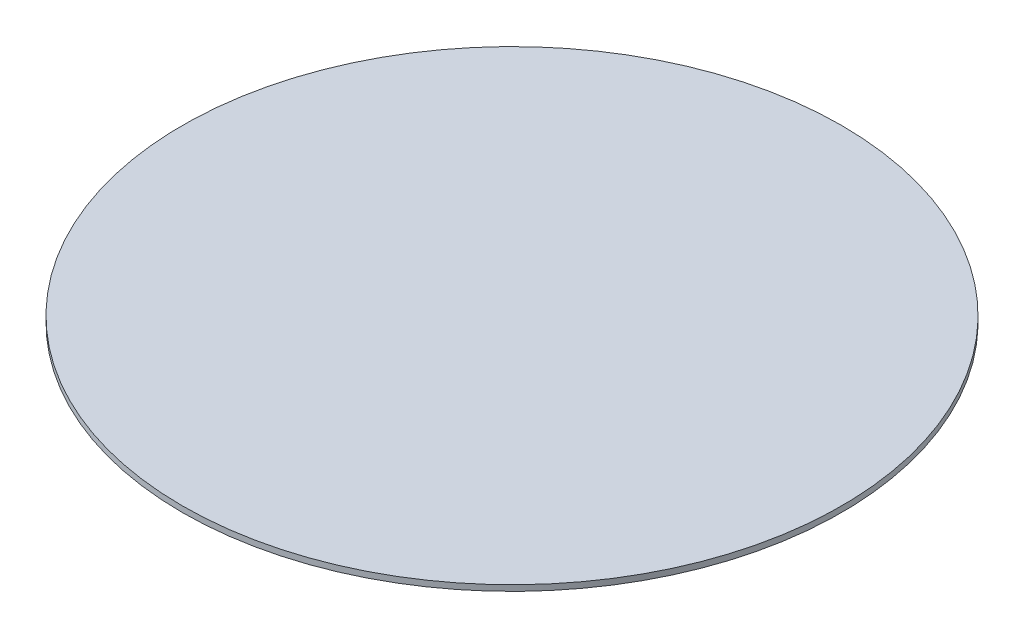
ISO-10303-21;
HEADER;
FILE_DESCRIPTION(('STEP AP214'),'2;1');
FILE_NAME('part.step','',(''),(''),'','','');
FILE_SCHEMA(('AUTOMOTIVE_DESIGN { 1 0 10303 214 1 1 1 1 }'));
ENDSEC;
DATA;
#1=APPLICATION_CONTEXT('core data for automotive mechanical design processes');
#2=APPLICATION_PROTOCOL_DEFINITION('international standard','automotive_design',2000,#1);
#3=PRODUCT_CONTEXT('',#1,'mechanical');
#4=PRODUCT('Part','Part','',(#3));
#5=PRODUCT_RELATED_PRODUCT_CATEGORY('part','',(#4));
#6=PRODUCT_DEFINITION_FORMATION('','',#4);
#7=PRODUCT_DEFINITION_CONTEXT('part definition',#1,'design');
#8=PRODUCT_DEFINITION('design','',#6,#7);
#9=PRODUCT_DEFINITION_SHAPE('','',#8);
#10=(LENGTH_UNIT() NAMED_UNIT(*) SI_UNIT(.MILLI.,.METRE.));
#11=(NAMED_UNIT(*) PLANE_ANGLE_UNIT() SI_UNIT($,.RADIAN.));
#12=(NAMED_UNIT(*) SI_UNIT($,.STERADIAN.) SOLID_ANGLE_UNIT());
#13=UNCERTAINTY_MEASURE_WITH_UNIT(LENGTH_MEASURE(1.E-05),#10,'distance_accuracy_value','');
#14=(GEOMETRIC_REPRESENTATION_CONTEXT(3) GLOBAL_UNCERTAINTY_ASSIGNED_CONTEXT((#13)) GLOBAL_UNIT_ASSIGNED_CONTEXT((#10,
#11,#12)) REPRESENTATION_CONTEXT('',''));
#15=CARTESIAN_POINT('',(0.,0.,0.));
#16=DIRECTION('',(0.,0.,1.));
#17=DIRECTION('',(1.,0.,0.));
#18=AXIS2_PLACEMENT_3D('',#15,#16,#17);
#19=CARTESIAN_POINT('',(0.,1.1,0.));
#20=DIRECTION('',(0.,-1.,0.));
#21=DIRECTION('',(0.,0.,-1.));
#22=AXIS2_PLACEMENT_3D('',#19,#20,#21);
#23=CYLINDRICAL_SURFACE('',#22,62.499999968);
#24=CARTESIAN_POINT('',(0.,1.1,0.));
#25=DIRECTION('',(0.,1.,0.));
#26=DIRECTION('',(0.,0.,1.));
#27=AXIS2_PLACEMENT_3D('',#24,#25,#26);
#28=CIRCLE('',#27,62.499999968);
#29=CARTESIAN_POINT('',(0.,1.1,62.499999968));
#30=VERTEX_POINT('',#29);
#31=EDGE_CURVE('E10',#30,#30,#28,.T.);
#32=ORIENTED_EDGE('',*,*,#31,.F.);
#33=EDGE_LOOP('',(#32));
#34=FACE_BOUND('',#33,.T.);
#35=CARTESIAN_POINT('',(0.,0.,0.));
#36=DIRECTION('',(0.,1.,0.));
#37=DIRECTION('',(0.,0.,1.));
#38=AXIS2_PLACEMENT_3D('',#35,#36,#37);
#39=CIRCLE('',#38,62.499999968);
#40=CARTESIAN_POINT('',(0.,0.,62.499999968));
#41=VERTEX_POINT('',#40);
#42=EDGE_CURVE('E42',#41,#41,#39,.T.);
#43=ORIENTED_EDGE('',*,*,#42,.T.);
#44=EDGE_LOOP('',(#43));
#45=FACE_BOUND('',#44,.T.);
#46=ADVANCED_FACE('F39',(#34,#45),#23,.T.);
#47=CARTESIAN_POINT('',(0.,1.1,0.));
#48=DIRECTION('',(0.,1.,0.));
#49=DIRECTION('',(0.,0.,1.));
#50=AXIS2_PLACEMENT_3D('',#47,#48,#49);
#51=PLANE('',#50);
#52=ORIENTED_EDGE('',*,*,#31,.T.);
#53=EDGE_LOOP('',(#52));
#54=FACE_BOUND('',#53,.T.);
#55=ADVANCED_FACE('F56',(#54),#51,.T.);
#56=CARTESIAN_POINT('',(0.,0.,0.));
#57=DIRECTION('',(0.,1.,0.));
#58=DIRECTION('',(0.,0.,1.));
#59=AXIS2_PLACEMENT_3D('',#56,#57,#58);
#60=PLANE('',#59);
#61=ORIENTED_EDGE('',*,*,#42,.F.);
#62=EDGE_LOOP('',(#61));
#63=FACE_BOUND('',#62,.T.);
#64=ADVANCED_FACE('F54',(#63),#60,.F.);
#65=CLOSED_SHELL('',(#46,#55,#64));
#66=MANIFOLD_SOLID_BREP('B2',#65);
#67=ADVANCED_BREP_SHAPE_REPRESENTATION('',(#18,#66),#14);
#68=SHAPE_DEFINITION_REPRESENTATION(#9,#67);
ENDSEC;
END-ISO-10303-21;
